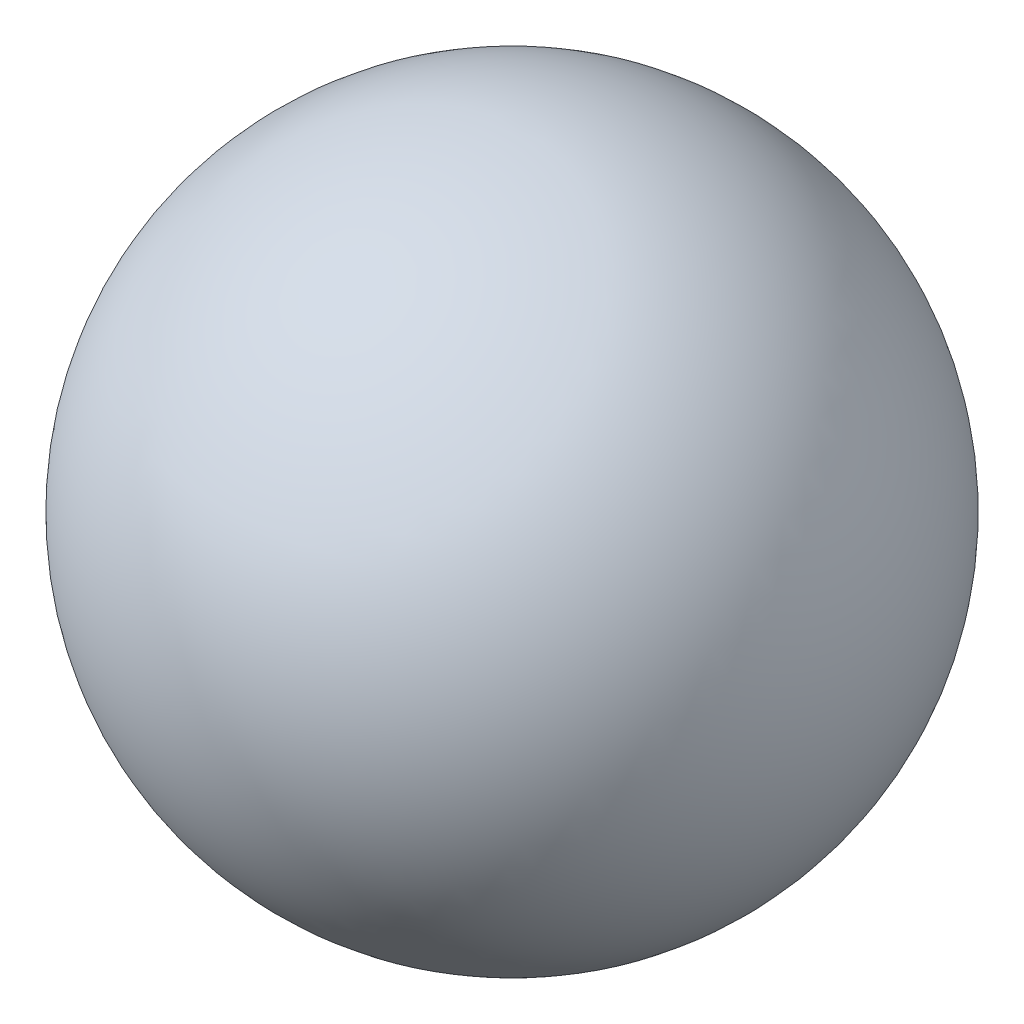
ISO-10303-21;
HEADER;
FILE_DESCRIPTION(('STEP AP214'),'2;1');
FILE_NAME('part.step','',(''),(''),'','','');
FILE_SCHEMA(('AUTOMOTIVE_DESIGN { 1 0 10303 214 1 1 1 1 }'));
ENDSEC;
DATA;
#1=APPLICATION_CONTEXT('core data for automotive mechanical design processes');
#2=APPLICATION_PROTOCOL_DEFINITION('international standard','automotive_design',2000,#1);
#3=PRODUCT_CONTEXT('',#1,'mechanical');
#4=PRODUCT('Part','Part','',(#3));
#5=PRODUCT_RELATED_PRODUCT_CATEGORY('part','',(#4));
#6=PRODUCT_DEFINITION_FORMATION('','',#4);
#7=PRODUCT_DEFINITION_CONTEXT('part definition',#1,'design');
#8=PRODUCT_DEFINITION('design','',#6,#7);
#9=PRODUCT_DEFINITION_SHAPE('','',#8);
#10=(LENGTH_UNIT() NAMED_UNIT(*) SI_UNIT(.MILLI.,.METRE.));
#11=(NAMED_UNIT(*) PLANE_ANGLE_UNIT() SI_UNIT($,.RADIAN.));
#12=(NAMED_UNIT(*) SI_UNIT($,.STERADIAN.) SOLID_ANGLE_UNIT());
#13=UNCERTAINTY_MEASURE_WITH_UNIT(LENGTH_MEASURE(1.E-05),#10,'distance_accuracy_value','');
#14=(GEOMETRIC_REPRESENTATION_CONTEXT(3) GLOBAL_UNCERTAINTY_ASSIGNED_CONTEXT((#13)) GLOBAL_UNIT_ASSIGNED_CONTEXT((#10,
#11,#12)) REPRESENTATION_CONTEXT('',''));
#15=CARTESIAN_POINT('',(0.,0.,0.));
#16=DIRECTION('',(0.,0.,1.));
#17=DIRECTION('',(1.,0.,0.));
#18=AXIS2_PLACEMENT_3D('',#15,#16,#17);
#19=CARTESIAN_POINT('',(-6.04166666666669,26.7500000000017,5.81793243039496E-13));
#20=DIRECTION('',(0.,1.00000000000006,0.));
#21=DIRECTION('',(1.,0.,0.));
#22=AXIS2_PLACEMENT_3D('',#19,#20,#21);
#23=SPHERICAL_SURFACE('',#22,4.625);
#24=CARTESIAN_POINT('',(-6.0416666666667,31.375000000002,6.91420827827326E-13));
#25=VERTEX_POINT('',#24);
#26=VERTEX_LOOP('',#25);
#27=FACE_BOUND('',#26,.T.);
#28=ADVANCED_FACE('F35',(#27),#23,.T.);
#29=CLOSED_SHELL('',(#28));
#30=MANIFOLD_SOLID_BREP('B2',#29);
#31=ADVANCED_BREP_SHAPE_REPRESENTATION('',(#18,#30),#14);
#32=SHAPE_DEFINITION_REPRESENTATION(#9,#31);
ENDSEC;
END-ISO-10303-21;
